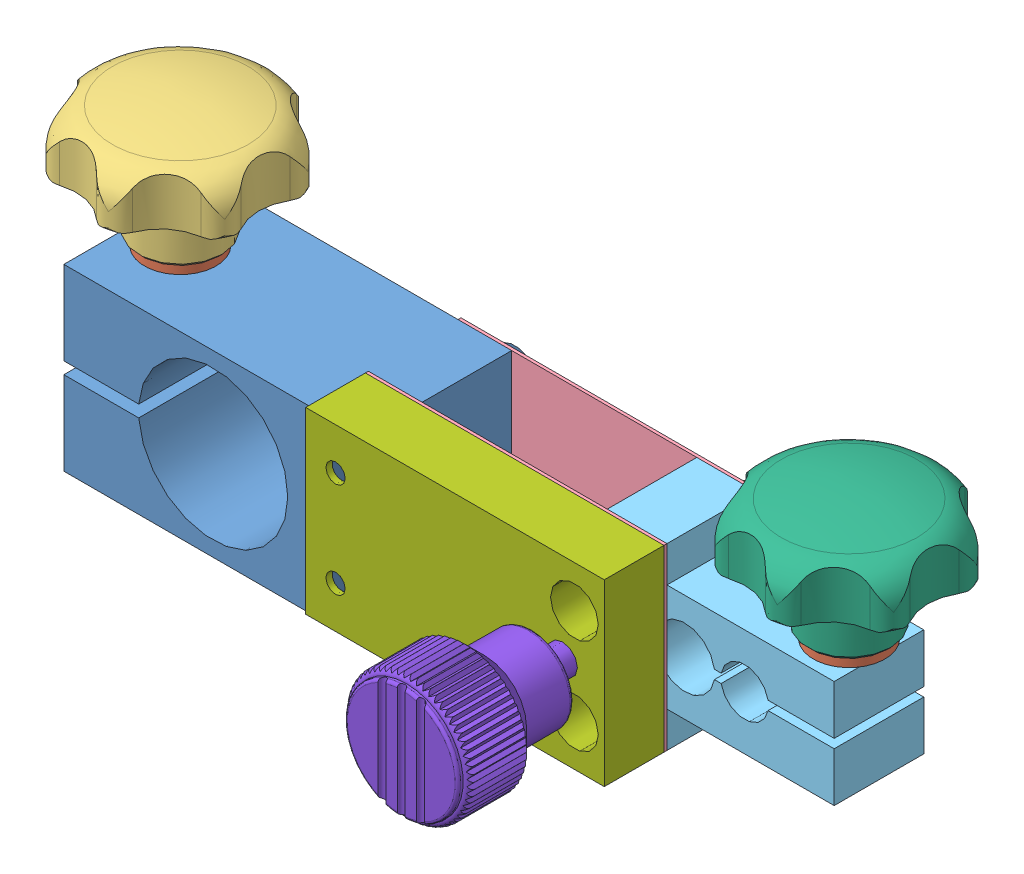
SolidWorks assembly 31141-079.sldasm, configuration Default (file format 4400). Lengths in mm.
Overall size (137.71 51.6 60.67).
16 component instances, 10 part files, 0 mates.
Components (placement in the parent):
- 31141-079_halter1_-1: 31141-079_halter1_.sldprt [Default] at origin size (50 30 25)
- 07300-06-1: 07300-06.sldprt [Default] at (-18 15 0) x (0 1 0) z (-1 0 0) size (1.6 12 12)
- 06220-4061X25_schwarz-1: 06220-4061X25_schwarz.sldprt [Default] at (-18 16.6 0) x (0 0 -1) z (1 0 0) size (31.35 45 30.71)
- 31141-079_blech-1: 31141-079_blech.sldprt [Default] at (41 0 2.5) size (50 30 0.5)
- 31141-079_halter2-1: 31141-079_halter2.sldprt [Default] at (69 0 -5) size (38 30 15)
- 07300-06-2: 07300-06.sldprt [Default] at (89 9 -5) x (0 1 0) z (-1 0 0) size (1.6 12 12)
- 06220-4061X15_schwarz-1: 06220-4061X15_schwarz.sldprt [Default] at (89 10.6 -5) x (0 0 -1) z (1 0 0) size (31.35 35 30.71)
- 31141-079_platte-1: 31141-079_platte.sldprt [Default] at (41 0 3) size (50 30 10)
- 06092-105X15-1: 06092-105X15.sldprt [Default] at (59 0 18) x (1 0 0) z (0 -1 0) size (21.02 37 21.02)
- M 4_6_schraube-1: M 4_6_schraube.sldprt [Default] at (61 8 3) x (0 0 -1) z (-1 0 0) size (10 7 7)
- M 4_6_schraube-2: M 4_6_schraube.sldprt [Default] at (61 -8 3) x (0 0 -1) z (-1 0 0) size (10 7 7)
- 31141-079_blech-2: 31141-079_blech.sldprt [Default] at (41 0 -12.5) x (-1 0 0) z (0 0 -1) size (50 30 0.5)
- M 4_6_schraube-3: M 4_6_schraube.sldprt [Default] at (61 8 -13) x (0 0 1) z (1 0 0) size (10 7 7)
- M 4_25_schraube-1: M 4_25_schraube.sldprt [Default] at (21 8 -13) x (0 0 1) z (1 0 0) size (29 7 7)
- M 4_6_schraube-4: M 4_6_schraube.sldprt [Default] at (61 -8 -13) x (0 0 1) z (1 0 0) size (10 7 7)
- M 4_25_schraube-2: M 4_25_schraube.sldprt [Default] at (21 -8 -13) x (0 0 1) z (1 0 0) size (29 7 7)
